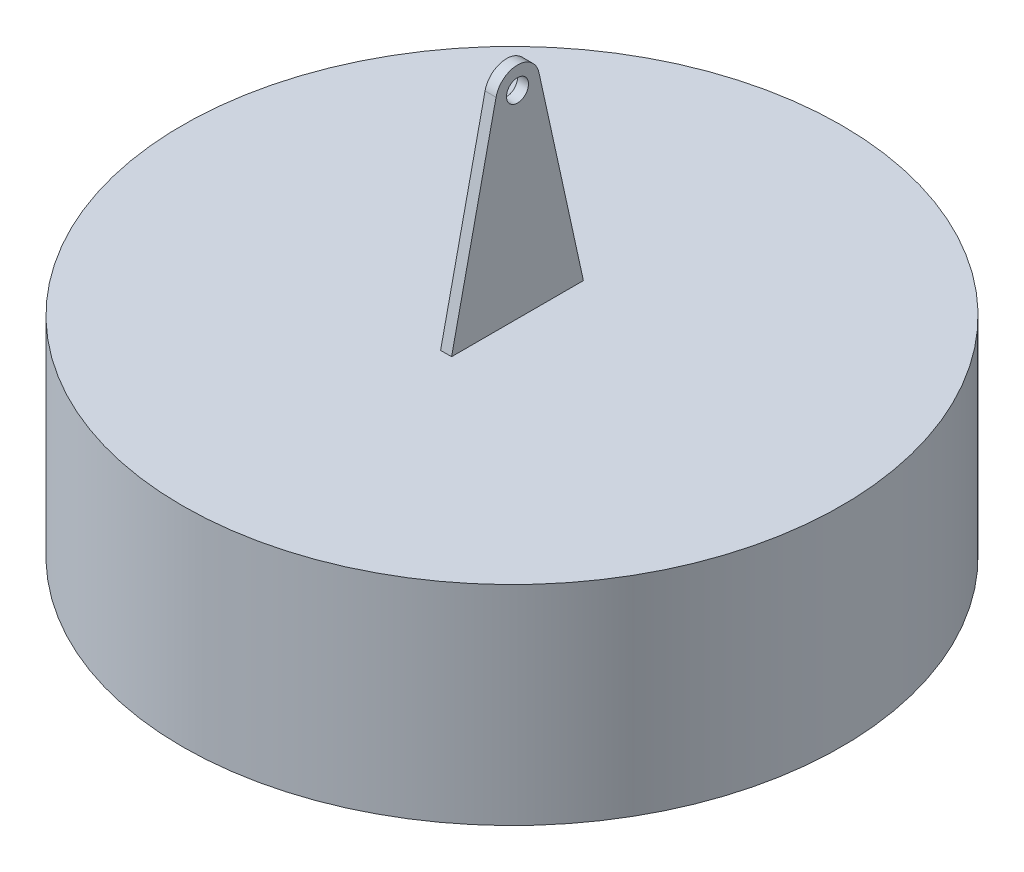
from build123d import *

# Parameters (mm, degrees)
SKETCH1_R           = 762
BOSS_EXTRUDE1_DEPTH = 482.6
SKETCH2_R           = 25.4
BOSS_EXTRUDE2_DEPTH = 12.7


with BuildPart() as part:
    # Sketch1 → Boss-Extrude1 (new body)
    with BuildSketch(Plane(origin=(0, 0, 0), x_dir=(1, 0, 0), z_dir=(0, 1, 0))):
        with Locations(Location((0, 0, 0), (0, 0, 90))):
            Circle(SKETCH1_R)
    extrude(amount=BOSS_EXTRUDE1_DEPTH)

    # Sketch2 → Boss-Extrude2 (add, symmetric)
    with BuildSketch(Plane(origin=(0, 0, 0), x_dir=(0, 0, -1), z_dir=(1, 0, 0))):
        with BuildLine():
            Line((49.617957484, 950.694874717), (152.4, 482.6))
            Line((152.4, 482.6), (-152.4, 482.6))
            Line((-152.4, 482.6), (-49.617957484, 950.694874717))
            ThreePointArc((-49.617957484, 950.694874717), (0, 990.6), (49.617957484, 950.694874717))
        make_face()
        with Locations((0, 939.8)):
            Circle(SKETCH2_R, mode=Mode.SUBTRACT)
    extrude(amount=BOSS_EXTRUDE2_DEPTH, both=True)


solid = part.part
